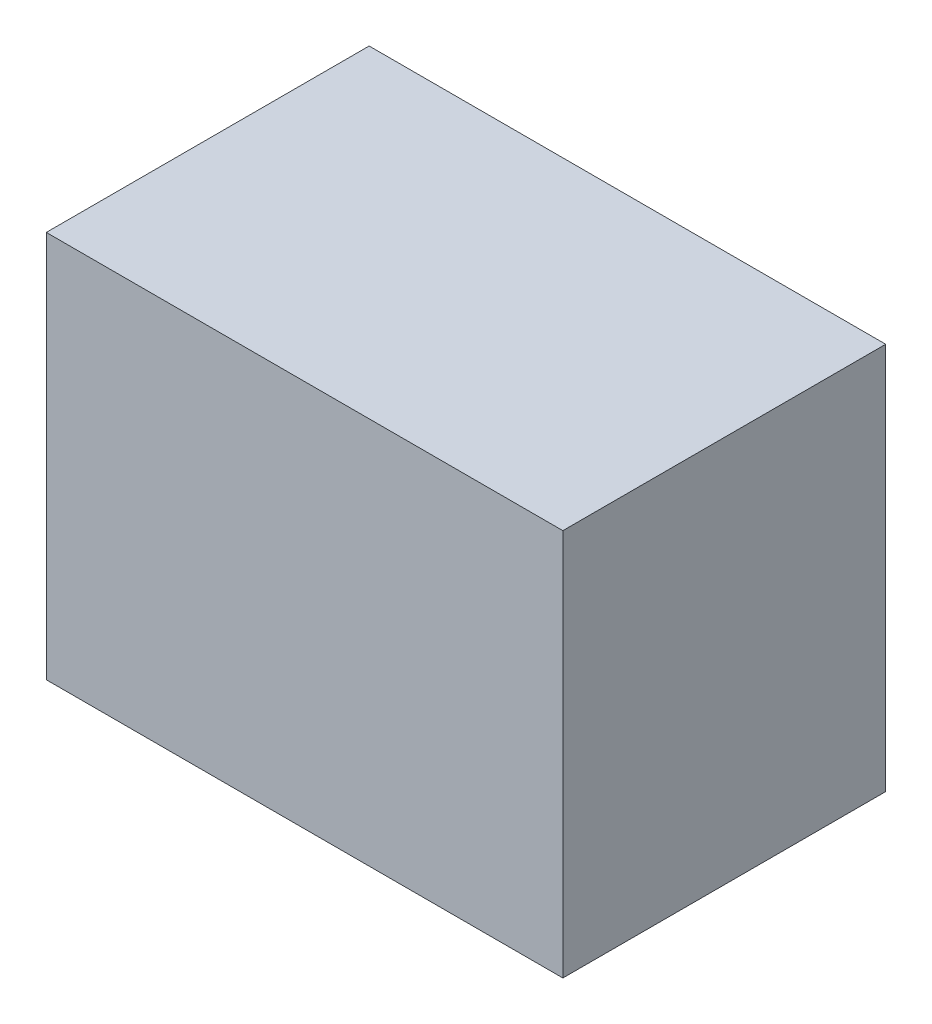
from build123d import *

# Parameters (mm, degrees)
SKETCH1_W      = 203.2
SKETCH1_H      = 152.4
EXTRUDE1_DEPTH = 127


with BuildPart() as part:
    # Sketch1 → Extrude1 (new body)
    with BuildSketch(Plane.XY):
        with Locations((4.069652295, 1.589284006)):
            Rectangle(SKETCH1_W, SKETCH1_H)
    extrude(amount=EXTRUDE1_DEPTH)


solid = part.part
